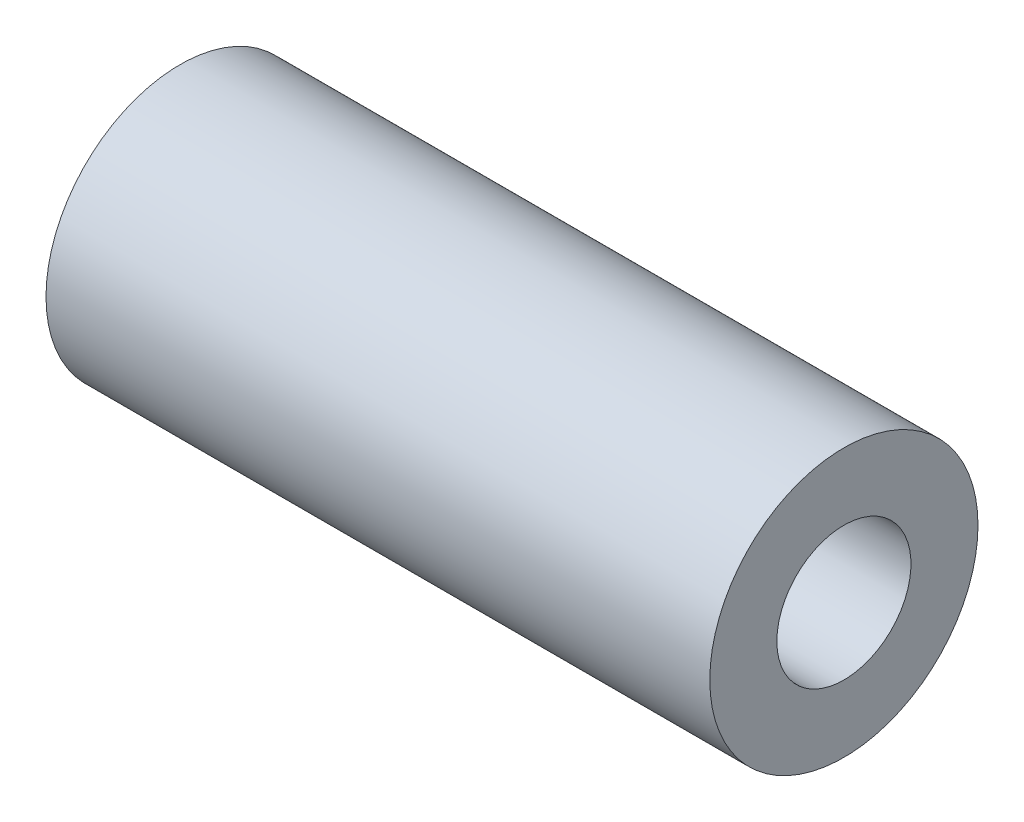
from build123d import *

# Parameters (mm, degrees)
SCHIZZO1_W = 49.5
SCHIZZO1_H = 5


with BuildPart() as part:
    # Schizzo1 → Rivoluzione1 (revolve)
    with BuildSketch(Plane.XY, mode=Mode.PRIVATE) as rivoluzione1_sk:
        with Locations((6.369823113, 7.5)):
            Rectangle(SCHIZZO1_W, SCHIZZO1_H)
    revolve(rivoluzione1_sk.sketch.rotate(Axis((-25.572018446, 0, 0), (1, 0, 0)), 90), axis=Axis((-25.572018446, 0, 0), (1, 0, 0)))


solid = part.part
